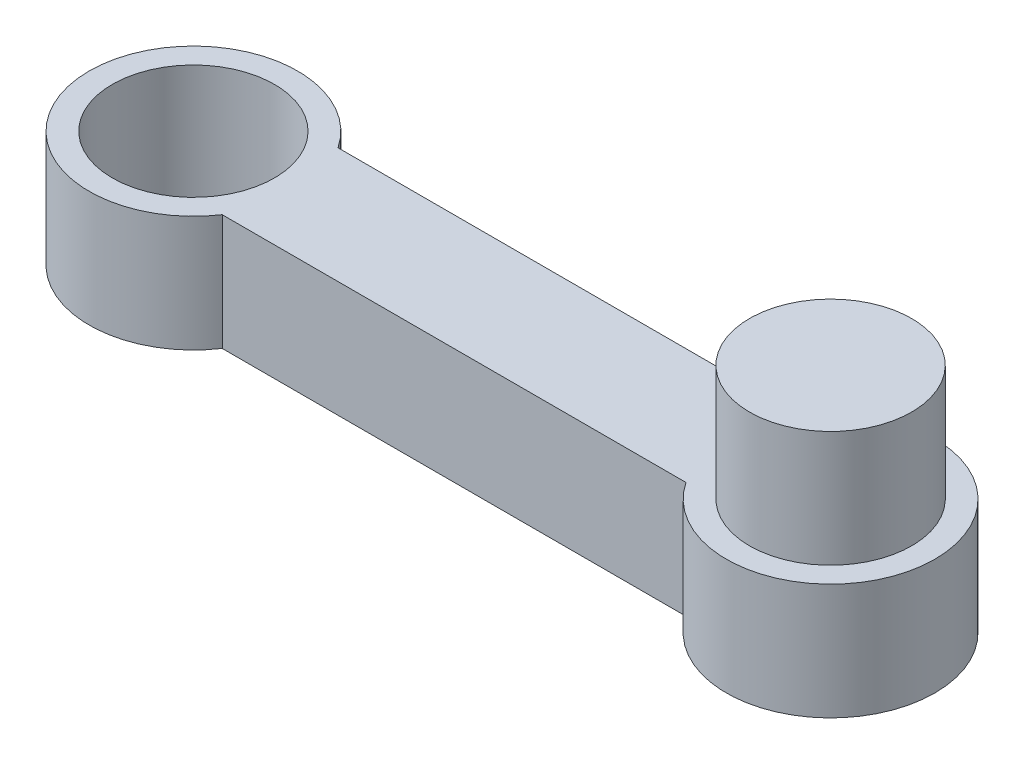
ISO-10303-21;
HEADER;
FILE_DESCRIPTION(('STEP AP214'),'2;1');
FILE_NAME('part.step','',(''),(''),'','','');
FILE_SCHEMA(('AUTOMOTIVE_DESIGN { 1 0 10303 214 1 1 1 1 }'));
ENDSEC;
DATA;
#1=APPLICATION_CONTEXT('core data for automotive mechanical design processes');
#2=APPLICATION_PROTOCOL_DEFINITION('international standard','automotive_design',2000,#1);
#3=PRODUCT_CONTEXT('',#1,'mechanical');
#4=PRODUCT('Part','Part','',(#3));
#5=PRODUCT_RELATED_PRODUCT_CATEGORY('part','',(#4));
#6=PRODUCT_DEFINITION_FORMATION('','',#4);
#7=PRODUCT_DEFINITION_CONTEXT('part definition',#1,'design');
#8=PRODUCT_DEFINITION('design','',#6,#7);
#9=PRODUCT_DEFINITION_SHAPE('','',#8);
#10=(LENGTH_UNIT() NAMED_UNIT(*) SI_UNIT(.MILLI.,.METRE.));
#11=(NAMED_UNIT(*) PLANE_ANGLE_UNIT() SI_UNIT($,.RADIAN.));
#12=(NAMED_UNIT(*) SI_UNIT($,.STERADIAN.) SOLID_ANGLE_UNIT());
#13=UNCERTAINTY_MEASURE_WITH_UNIT(LENGTH_MEASURE(1.E-05),#10,'distance_accuracy_value','');
#14=(GEOMETRIC_REPRESENTATION_CONTEXT(3) GLOBAL_UNCERTAINTY_ASSIGNED_CONTEXT((#13)) GLOBAL_UNIT_ASSIGNED_CONTEXT((#10,
#11,#12)) REPRESENTATION_CONTEXT('',''));
#15=CARTESIAN_POINT('',(0.,0.,0.));
#16=DIRECTION('',(0.,0.,1.));
#17=DIRECTION('',(1.,0.,0.));
#18=AXIS2_PLACEMENT_3D('',#15,#16,#17);
#19=CARTESIAN_POINT('',(-242.625717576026,100.,-175.992438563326));
#20=DIRECTION('',(1.,0.,-1.10744049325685E-13));
#21=DIRECTION('',(-1.10744049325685E-13,0.,-1.));
#22=AXIS2_PLACEMENT_3D('',#19,#20,#21);
#23=PLANE('',#22);
#24=DIRECTION('',(1.10744049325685E-13,0.,1.));
#25=VECTOR('',#24,1.);
#26=CARTESIAN_POINT('',(-242.625717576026,0.,-175.992438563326));
#27=LINE('',#26,#25);
#28=CARTESIAN_POINT('',(-242.625717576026,0.,-176.243066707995));
#29=VERTEX_POINT('',#28);
#30=CARTESIAN_POINT('',(-242.625717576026,0.,-175.992438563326));
#31=VERTEX_POINT('',#30);
#32=EDGE_CURVE('E135',#29,#31,#27,.T.);
#33=ORIENTED_EDGE('',*,*,#32,.T.);
#34=DIRECTION('',(0.,-1.,0.));
#35=VECTOR('',#34,1.);
#36=CARTESIAN_POINT('',(-242.625717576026,100.,-175.992438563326));
#37=LINE('',#36,#35);
#38=CARTESIAN_POINT('',(-242.625717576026,100.,-175.992438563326));
#39=VERTEX_POINT('',#38);
#40=EDGE_CURVE('E11',#39,#31,#37,.T.);
#41=ORIENTED_EDGE('',*,*,#40,.F.);
#42=DIRECTION('',(1.10744049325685E-13,0.,1.));
#43=VECTOR('',#42,1.);
#44=CARTESIAN_POINT('',(-242.625717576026,100.,-175.992438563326));
#45=LINE('',#44,#43);
#46=CARTESIAN_POINT('',(-242.625717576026,100.,-176.243066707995));
#47=VERTEX_POINT('',#46);
#48=EDGE_CURVE('E150',#47,#39,#45,.T.);
#49=ORIENTED_EDGE('',*,*,#48,.F.);
#50=DIRECTION('',(0.,-1.,0.));
#51=VECTOR('',#50,1.);
#52=CARTESIAN_POINT('',(-242.625717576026,100.,-176.243066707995));
#53=LINE('',#52,#51);
#54=EDGE_CURVE('E131',#47,#29,#53,.T.);
#55=ORIENTED_EDGE('',*,*,#54,.T.);
#56=EDGE_LOOP('',(#33,#41,#49,#55));
#57=FACE_BOUND('',#56,.T.);
#58=ADVANCED_FACE('F39',(#57),#23,.F.);
#59=CARTESIAN_POINT('',(-242.625717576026,100.,-175.992438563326));
#60=DIRECTION('',(0.,0.,-1.));
#61=DIRECTION('',(-1.,0.,0.));
#62=AXIS2_PLACEMENT_3D('',#59,#60,#61);
#63=PLANE('',#62);
#64=DIRECTION('',(1.,0.,0.));
#65=VECTOR('',#64,1.);
#66=CARTESIAN_POINT('',(-242.625717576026,0.,-175.992438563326));
#67=LINE('',#66,#65);
#68=CARTESIAN_POINT('',(157.374282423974,0.,-175.992438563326));
#69=VERTEX_POINT('',#68);
#70=EDGE_CURVE('E138',#31,#69,#67,.T.);
#71=ORIENTED_EDGE('',*,*,#70,.T.);
#72=DIRECTION('',(0.,-1.,0.));
#73=VECTOR('',#72,1.);
#74=CARTESIAN_POINT('',(157.374282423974,100.,-175.992438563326));
#75=LINE('',#74,#73);
#76=CARTESIAN_POINT('',(157.374282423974,100.,-175.992438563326));
#77=VERTEX_POINT('',#76);
#78=EDGE_CURVE('E47',#77,#69,#75,.T.);
#79=ORIENTED_EDGE('',*,*,#78,.F.);
#80=DIRECTION('',(1.,0.,0.));
#81=VECTOR('',#80,1.);
#82=CARTESIAN_POINT('',(-242.625717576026,100.,-175.992438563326));
#83=LINE('',#82,#81);
#84=EDGE_CURVE('E98',#39,#77,#83,.T.);
#85=ORIENTED_EDGE('',*,*,#84,.F.);
#86=ORIENTED_EDGE('',*,*,#40,.T.);
#87=EDGE_LOOP('',(#71,#79,#85,#86));
#88=FACE_BOUND('',#87,.T.);
#89=ADVANCED_FACE('F220',(#88),#63,.F.);
#90=CARTESIAN_POINT('',(157.374282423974,100.,-175.992438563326));
#91=DIRECTION('',(-1.,0.,0.));
#92=DIRECTION('',(0.,0.,1.));
#93=AXIS2_PLACEMENT_3D('',#90,#91,#92);
#94=PLANE('',#93);
#95=DIRECTION('',(0.,0.,-1.));
#96=VECTOR('',#95,1.);
#97=CARTESIAN_POINT('',(157.374282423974,0.,-175.992438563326));
#98=LINE('',#97,#96);
#99=CARTESIAN_POINT('',(157.374282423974,0.,-176.243066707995));
#100=VERTEX_POINT('',#99);
#101=EDGE_CURVE('E141',#69,#100,#98,.T.);
#102=ORIENTED_EDGE('',*,*,#101,.T.);
#103=DIRECTION('',(0.,-1.,0.));
#104=VECTOR('',#103,1.);
#105=CARTESIAN_POINT('',(157.374282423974,100.,-176.243066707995));
#106=LINE('',#105,#104);
#107=CARTESIAN_POINT('',(157.374282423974,100.,-176.243066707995));
#108=VERTEX_POINT('',#107);
#109=EDGE_CURVE('E157',#108,#100,#106,.T.);
#110=ORIENTED_EDGE('',*,*,#109,.F.);
#111=DIRECTION('',(0.,0.,-1.));
#112=VECTOR('',#111,1.);
#113=CARTESIAN_POINT('',(157.374282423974,100.,-175.992438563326));
#114=LINE('',#113,#112);
#115=EDGE_CURVE('E165',#77,#108,#114,.T.);
#116=ORIENTED_EDGE('',*,*,#115,.F.);
#117=ORIENTED_EDGE('',*,*,#78,.T.);
#118=EDGE_LOOP('',(#102,#110,#116,#117));
#119=FACE_BOUND('',#118,.T.);
#120=ADVANCED_FACE('F163',(#119),#94,.F.);
#121=CARTESIAN_POINT('',(232.374282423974,100.,-225.992438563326));
#122=DIRECTION('',(0.,-1.,0.));
#123=DIRECTION('',(0.,0.,-1.));
#124=AXIS2_PLACEMENT_3D('',#121,#122,#123);
#125=CYLINDRICAL_SURFACE('',#124,90.);
#126=CARTESIAN_POINT('',(232.374282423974,0.,-225.992438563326));
#127=DIRECTION('',(0.,1.,0.));
#128=DIRECTION('',(0.,0.,1.));
#129=AXIS2_PLACEMENT_3D('',#126,#127,#128);
#130=CIRCLE('',#129,90.);
#131=CARTESIAN_POINT('',(157.374282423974,0.,-275.741810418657));
#132=VERTEX_POINT('',#131);
#133=EDGE_CURVE('E143',#100,#132,#130,.T.);
#134=ORIENTED_EDGE('',*,*,#133,.T.);
#135=DIRECTION('',(0.,-1.,0.));
#136=VECTOR('',#135,1.);
#137=CARTESIAN_POINT('',(157.374282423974,100.,-275.741810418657));
#138=LINE('',#137,#136);
#139=CARTESIAN_POINT('',(157.374282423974,100.,-275.741810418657));
#140=VERTEX_POINT('',#139);
#141=EDGE_CURVE('E154',#140,#132,#138,.T.);
#142=ORIENTED_EDGE('',*,*,#141,.F.);
#143=CARTESIAN_POINT('',(232.374282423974,100.,-225.992438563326));
#144=DIRECTION('',(0.,1.,0.));
#145=DIRECTION('',(0.,0.,1.));
#146=AXIS2_PLACEMENT_3D('',#143,#144,#145);
#147=CIRCLE('',#146,90.);
#148=EDGE_CURVE('E177',#108,#140,#147,.T.);
#149=ORIENTED_EDGE('',*,*,#148,.F.);
#150=ORIENTED_EDGE('',*,*,#109,.T.);
#151=EDGE_LOOP('',(#134,#142,#149,#150));
#152=FACE_BOUND('',#151,.T.);
#153=ADVANCED_FACE('F173',(#152),#125,.T.);
#154=CARTESIAN_POINT('',(157.374282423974,100.,-275.741810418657));
#155=DIRECTION('',(-1.,0.,0.));
#156=DIRECTION('',(0.,0.,1.));
#157=AXIS2_PLACEMENT_3D('',#154,#155,#156);
#158=PLANE('',#157);
#159=DIRECTION('',(0.,0.,-1.));
#160=VECTOR('',#159,1.);
#161=CARTESIAN_POINT('',(157.374282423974,0.,-275.741810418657));
#162=LINE('',#161,#160);
#163=CARTESIAN_POINT('',(157.374282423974,0.,-275.992438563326));
#164=VERTEX_POINT('',#163);
#165=EDGE_CURVE('E145',#132,#164,#162,.T.);
#166=ORIENTED_EDGE('',*,*,#165,.T.);
#167=DIRECTION('',(0.,-1.,0.));
#168=VECTOR('',#167,1.);
#169=CARTESIAN_POINT('',(157.374282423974,100.,-275.992438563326));
#170=LINE('',#169,#168);
#171=CARTESIAN_POINT('',(157.374282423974,100.,-275.992438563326));
#172=VERTEX_POINT('',#171);
#173=EDGE_CURVE('E126',#172,#164,#170,.T.);
#174=ORIENTED_EDGE('',*,*,#173,.F.);
#175=DIRECTION('',(0.,0.,-1.));
#176=VECTOR('',#175,1.);
#177=CARTESIAN_POINT('',(157.374282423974,100.,-275.741810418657));
#178=LINE('',#177,#176);
#179=EDGE_CURVE('E117',#140,#172,#178,.T.);
#180=ORIENTED_EDGE('',*,*,#179,.F.);
#181=ORIENTED_EDGE('',*,*,#141,.T.);
#182=EDGE_LOOP('',(#166,#174,#180,#181));
#183=FACE_BOUND('',#182,.T.);
#184=ADVANCED_FACE('F176',(#183),#158,.F.);
#185=CARTESIAN_POINT('',(-242.625717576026,100.,-275.992438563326));
#186=DIRECTION('',(0.,0.,1.));
#187=DIRECTION('',(1.,0.,0.));
#188=AXIS2_PLACEMENT_3D('',#185,#186,#187);
#189=PLANE('',#188);
#190=DIRECTION('',(-1.,0.,0.));
#191=VECTOR('',#190,1.);
#192=CARTESIAN_POINT('',(-242.625717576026,0.,-275.992438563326));
#193=LINE('',#192,#191);
#194=CARTESIAN_POINT('',(-242.625717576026,0.,-275.992438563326));
#195=VERTEX_POINT('',#194);
#196=EDGE_CURVE('E125',#164,#195,#193,.T.);
#197=ORIENTED_EDGE('',*,*,#196,.T.);
#198=DIRECTION('',(0.,-1.,0.));
#199=VECTOR('',#198,1.);
#200=CARTESIAN_POINT('',(-242.625717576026,100.,-275.992438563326));
#201=LINE('',#200,#199);
#202=CARTESIAN_POINT('',(-242.625717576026,100.,-275.992438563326));
#203=VERTEX_POINT('',#202);
#204=EDGE_CURVE('E122',#203,#195,#201,.T.);
#205=ORIENTED_EDGE('',*,*,#204,.F.);
#206=DIRECTION('',(-1.,0.,0.));
#207=VECTOR('',#206,1.);
#208=CARTESIAN_POINT('',(-242.625717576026,100.,-275.992438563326));
#209=LINE('',#208,#207);
#210=EDGE_CURVE('E111',#172,#203,#209,.T.);
#211=ORIENTED_EDGE('',*,*,#210,.F.);
#212=ORIENTED_EDGE('',*,*,#173,.T.);
#213=EDGE_LOOP('',(#197,#205,#211,#212));
#214=FACE_BOUND('',#213,.T.);
#215=ADVANCED_FACE('F123',(#214),#189,.F.);
#216=CARTESIAN_POINT('',(-242.625717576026,100.,-275.741810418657));
#217=DIRECTION('',(1.,0.,0.));
#218=DIRECTION('',(0.,0.,-1.));
#219=AXIS2_PLACEMENT_3D('',#216,#217,#218);
#220=PLANE('',#219);
#221=DIRECTION('',(0.,0.,1.));
#222=VECTOR('',#221,1.);
#223=CARTESIAN_POINT('',(-242.625717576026,0.,-275.741810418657));
#224=LINE('',#223,#222);
#225=CARTESIAN_POINT('',(-242.625717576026,0.,-275.741810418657));
#226=VERTEX_POINT('',#225);
#227=EDGE_CURVE('E84',#195,#226,#224,.T.);
#228=ORIENTED_EDGE('',*,*,#227,.T.);
#229=DIRECTION('',(0.,-1.,0.));
#230=VECTOR('',#229,1.);
#231=CARTESIAN_POINT('',(-242.625717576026,100.,-275.741810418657));
#232=LINE('',#231,#230);
#233=CARTESIAN_POINT('',(-242.625717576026,100.,-275.741810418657));
#234=VERTEX_POINT('',#233);
#235=EDGE_CURVE('E127',#234,#226,#232,.T.);
#236=ORIENTED_EDGE('',*,*,#235,.F.);
#237=DIRECTION('',(0.,0.,1.));
#238=VECTOR('',#237,1.);
#239=CARTESIAN_POINT('',(-242.625717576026,100.,-275.741810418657));
#240=LINE('',#239,#238);
#241=EDGE_CURVE('E115',#203,#234,#240,.T.);
#242=ORIENTED_EDGE('',*,*,#241,.F.);
#243=ORIENTED_EDGE('',*,*,#204,.T.);
#244=EDGE_LOOP('',(#228,#236,#242,#243));
#245=FACE_BOUND('',#244,.T.);
#246=ADVANCED_FACE('F129',(#245),#220,.F.);
#247=CARTESIAN_POINT('',(-317.625717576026,100.,-225.992438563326));
#248=DIRECTION('',(0.,-1.,0.));
#249=DIRECTION('',(0.,0.,-1.));
#250=AXIS2_PLACEMENT_3D('',#247,#248,#249);
#251=CYLINDRICAL_SURFACE('',#250,90.);
#252=CARTESIAN_POINT('',(-317.625717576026,0.,-225.992438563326));
#253=DIRECTION('',(0.,1.,0.));
#254=DIRECTION('',(0.,0.,1.));
#255=AXIS2_PLACEMENT_3D('',#252,#253,#254);
#256=CIRCLE('',#255,90.);
#257=EDGE_CURVE('E90',#226,#29,#256,.T.);
#258=ORIENTED_EDGE('',*,*,#257,.T.);
#259=ORIENTED_EDGE('',*,*,#54,.F.);
#260=CARTESIAN_POINT('',(-317.625717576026,100.,-225.992438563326));
#261=DIRECTION('',(0.,1.,0.));
#262=DIRECTION('',(0.,0.,1.));
#263=AXIS2_PLACEMENT_3D('',#260,#261,#262);
#264=CIRCLE('',#263,90.);
#265=EDGE_CURVE('E55',#234,#47,#264,.T.);
#266=ORIENTED_EDGE('',*,*,#265,.F.);
#267=ORIENTED_EDGE('',*,*,#235,.T.);
#268=EDGE_LOOP('',(#258,#259,#266,#267));
#269=FACE_BOUND('',#268,.T.);
#270=ADVANCED_FACE('F206',(#269),#251,.T.);
#271=CARTESIAN_POINT('',(-317.625717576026,100.,-225.992438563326));
#272=DIRECTION('',(0.,1.,0.));
#273=DIRECTION('',(0.,0.,1.));
#274=AXIS2_PLACEMENT_3D('',#271,#272,#273);
#275=PLANE('',#274);
#276=CARTESIAN_POINT('',(232.374282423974,100.,-225.992438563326));
#277=DIRECTION('',(0.,1.,0.));
#278=DIRECTION('',(0.,0.,1.));
#279=AXIS2_PLACEMENT_3D('',#276,#277,#278);
#280=CIRCLE('',#279,70.0000000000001);
#281=CARTESIAN_POINT('',(232.374282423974,100.,-155.992438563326));
#282=VERTEX_POINT('',#281);
#283=EDGE_CURVE('E189',#282,#282,#280,.T.);
#284=ORIENTED_EDGE('',*,*,#283,.F.);
#285=EDGE_LOOP('',(#284));
#286=FACE_BOUND('',#285,.T.);
#287=CARTESIAN_POINT('',(-317.625717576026,100.,-225.992438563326));
#288=DIRECTION('',(0.,1.,0.));
#289=DIRECTION('',(0.,0.,1.));
#290=AXIS2_PLACEMENT_3D('',#287,#288,#289);
#291=CIRCLE('',#290,70.);
#292=CARTESIAN_POINT('',(-317.625717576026,100.,-155.992438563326));
#293=VERTEX_POINT('',#292);
#294=EDGE_CURVE('E183',#293,#293,#291,.T.);
#295=ORIENTED_EDGE('',*,*,#294,.F.);
#296=EDGE_LOOP('',(#295));
#297=FACE_BOUND('',#296,.T.);
#298=ORIENTED_EDGE('',*,*,#48,.T.);
#299=ORIENTED_EDGE('',*,*,#84,.T.);
#300=ORIENTED_EDGE('',*,*,#115,.T.);
#301=ORIENTED_EDGE('',*,*,#148,.T.);
#302=ORIENTED_EDGE('',*,*,#179,.T.);
#303=ORIENTED_EDGE('',*,*,#210,.T.);
#304=ORIENTED_EDGE('',*,*,#241,.T.);
#305=ORIENTED_EDGE('',*,*,#265,.T.);
#306=EDGE_LOOP('',(#298,#299,#300,#301,#302,#303,#304,#305));
#307=FACE_BOUND('',#306,.T.);
#308=ADVANCED_FACE('F113',(#286,#297,#307),#275,.T.);
#309=CARTESIAN_POINT('',(-317.625717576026,0.,-225.992438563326));
#310=DIRECTION('',(0.,1.,0.));
#311=DIRECTION('',(0.,0.,1.));
#312=AXIS2_PLACEMENT_3D('',#309,#310,#311);
#313=PLANE('',#312);
#314=CARTESIAN_POINT('',(-317.625717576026,0.,-225.992438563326));
#315=DIRECTION('',(0.,1.,0.));
#316=DIRECTION('',(0.,0.,1.));
#317=AXIS2_PLACEMENT_3D('',#314,#315,#316);
#318=CIRCLE('',#317,70.);
#319=CARTESIAN_POINT('',(-317.625717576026,0.,-155.992438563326));
#320=VERTEX_POINT('',#319);
#321=EDGE_CURVE('E139',#320,#320,#318,.T.);
#322=ORIENTED_EDGE('',*,*,#321,.T.);
#323=EDGE_LOOP('',(#322));
#324=FACE_BOUND('',#323,.T.);
#325=ORIENTED_EDGE('',*,*,#32,.F.);
#326=ORIENTED_EDGE('',*,*,#257,.F.);
#327=ORIENTED_EDGE('',*,*,#227,.F.);
#328=ORIENTED_EDGE('',*,*,#196,.F.);
#329=ORIENTED_EDGE('',*,*,#165,.F.);
#330=ORIENTED_EDGE('',*,*,#133,.F.);
#331=ORIENTED_EDGE('',*,*,#101,.F.);
#332=ORIENTED_EDGE('',*,*,#70,.F.);
#333=EDGE_LOOP('',(#325,#326,#327,#328,#329,#330,#331,#332));
#334=FACE_BOUND('',#333,.T.);
#335=ADVANCED_FACE('F169',(#324,#334),#313,.F.);
#336=CARTESIAN_POINT('',(-317.625717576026,0.,-225.992438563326));
#337=DIRECTION('',(0.,1.,0.));
#338=DIRECTION('',(0.,0.,1.));
#339=AXIS2_PLACEMENT_3D('',#336,#337,#338);
#340=CYLINDRICAL_SURFACE('',#339,70.);
#341=ORIENTED_EDGE('',*,*,#321,.F.);
#342=EDGE_LOOP('',(#341));
#343=FACE_BOUND('',#342,.T.);
#344=ORIENTED_EDGE('',*,*,#294,.T.);
#345=EDGE_LOOP('',(#344));
#346=FACE_BOUND('',#345,.T.);
#347=ADVANCED_FACE('F200',(#343,#346),#340,.F.);
#348=CARTESIAN_POINT('',(232.374282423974,200.,-225.992438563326));
#349=DIRECTION('',(0.,-1.,0.));
#350=DIRECTION('',(0.,0.,-1.));
#351=AXIS2_PLACEMENT_3D('',#348,#349,#350);
#352=CYLINDRICAL_SURFACE('',#351,70.0000000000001);
#353=CARTESIAN_POINT('',(232.374282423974,200.,-225.992438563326));
#354=DIRECTION('',(0.,1.,0.));
#355=DIRECTION('',(0.,0.,1.));
#356=AXIS2_PLACEMENT_3D('',#353,#354,#355);
#357=CIRCLE('',#356,70.0000000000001);
#358=CARTESIAN_POINT('',(232.374282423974,200.,-155.992438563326));
#359=VERTEX_POINT('',#358);
#360=EDGE_CURVE('E186',#359,#359,#357,.T.);
#361=ORIENTED_EDGE('',*,*,#360,.F.);
#362=EDGE_LOOP('',(#361));
#363=FACE_BOUND('',#362,.T.);
#364=ORIENTED_EDGE('',*,*,#283,.T.);
#365=EDGE_LOOP('',(#364));
#366=FACE_BOUND('',#365,.T.);
#367=ADVANCED_FACE('F197',(#363,#366),#352,.T.);
#368=CARTESIAN_POINT('',(232.374282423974,200.,-225.992438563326));
#369=DIRECTION('',(0.,1.,0.));
#370=DIRECTION('',(0.,0.,1.));
#371=AXIS2_PLACEMENT_3D('',#368,#369,#370);
#372=PLANE('',#371);
#373=ORIENTED_EDGE('',*,*,#360,.T.);
#374=EDGE_LOOP('',(#373));
#375=FACE_BOUND('',#374,.T.);
#376=ADVANCED_FACE('F195',(#375),#372,.T.);
#377=CLOSED_SHELL('',(#58,#89,#120,#153,#184,#215,#246,#270,#308,#335,#347,#367,#376));
#378=MANIFOLD_SOLID_BREP('B2',#377);
#379=ADVANCED_BREP_SHAPE_REPRESENTATION('',(#18,#378),#14);
#380=SHAPE_DEFINITION_REPRESENTATION(#9,#379);
ENDSEC;
END-ISO-10303-21;
